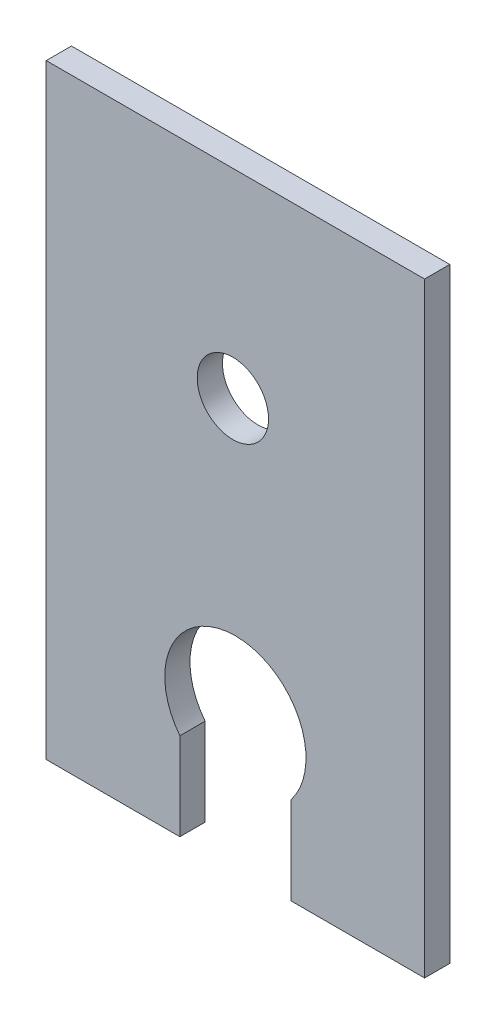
from build123d import *

# Parameters (mm, degrees)
ESQUISSE1_W             = 150
ESQUISSE1_H             = 240
BASE_EXTRUSION_DEPTH    = 10
ENL_V_MAT_EXTRU_1_DEPTH = 10
ESQUISSE3_R             = 14.142135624
ENL_V_MAT_EXTRU_2_DEPTH = 10


with BuildPart() as part:
    # Esquisse1 → Base-Extrusion (new body)
    with BuildSketch(Plane.XY):
        with Locations((75, 120)):
            Rectangle(ESQUISSE1_W, ESQUISSE1_H)
    extrude(amount=BASE_EXTRUSION_DEPTH)

    # Esquisse2 → Enl_v. mat.-Extru.1 (cut)
    with BuildSketch(Plane.XY.offset(10)):
        with BuildLine():
            Line((53, 0), (97, 0))
            Line((97, 0), (97, 34.679491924))
            ThreePointArc((97, 34.679491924), (75, 80), (53, 34.679491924))
            Line((53, 34.679491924), (53, 0))
        make_face()
    extrude(amount=-ENL_V_MAT_EXTRU_1_DEPTH, mode=Mode.SUBTRACT)

    # Esquisse3 → Enl_v. mat.-Extru.2 (cut)
    with BuildSketch(Plane.XY.offset(10)):
        with Locations((74, 161)):
            Circle(ESQUISSE3_R)
    extrude(amount=-ENL_V_MAT_EXTRU_2_DEPTH, mode=Mode.SUBTRACT)


solid = part.part
